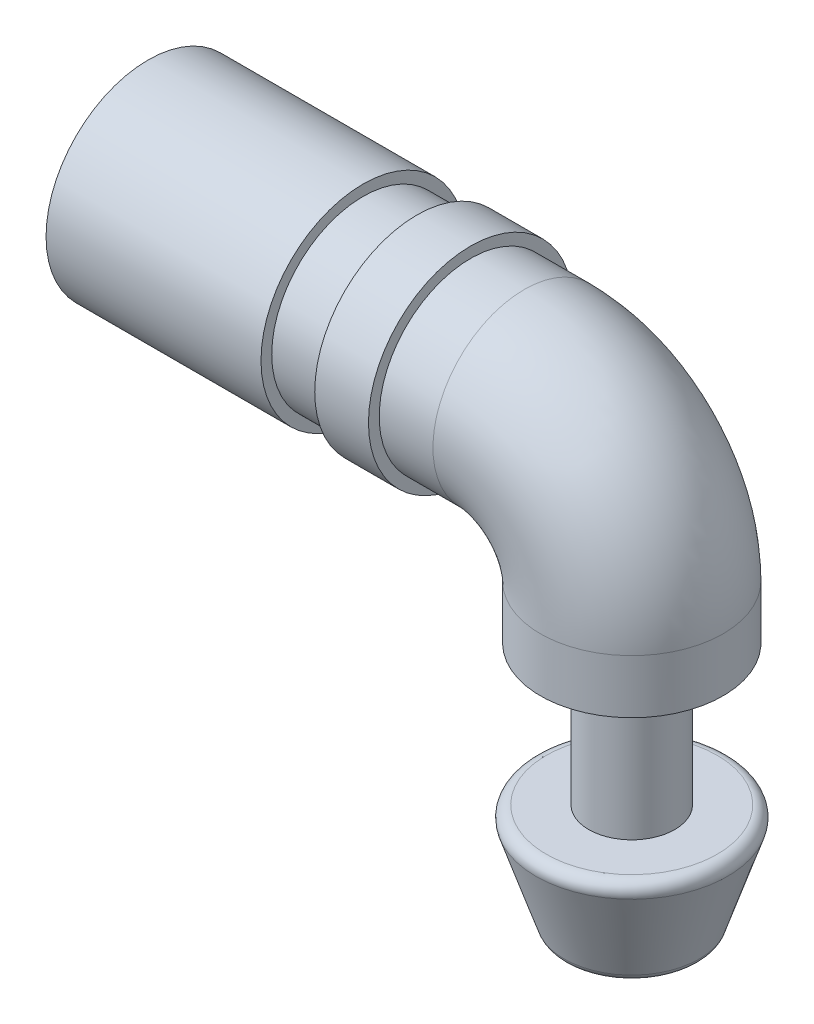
ISO-10303-21;
HEADER;
FILE_DESCRIPTION(('STEP AP214'),'2;1');
FILE_NAME('part.step','',(''),(''),'','','');
FILE_SCHEMA(('AUTOMOTIVE_DESIGN { 1 0 10303 214 1 1 1 1 }'));
ENDSEC;
DATA;
#1=APPLICATION_CONTEXT('core data for automotive mechanical design processes');
#2=APPLICATION_PROTOCOL_DEFINITION('international standard','automotive_design',2000,#1);
#3=PRODUCT_CONTEXT('',#1,'mechanical');
#4=PRODUCT('Part','Part','',(#3));
#5=PRODUCT_RELATED_PRODUCT_CATEGORY('part','',(#4));
#6=PRODUCT_DEFINITION_FORMATION('','',#4);
#7=PRODUCT_DEFINITION_CONTEXT('part definition',#1,'design');
#8=PRODUCT_DEFINITION('design','',#6,#7);
#9=PRODUCT_DEFINITION_SHAPE('','',#8);
#10=(LENGTH_UNIT() NAMED_UNIT(*) SI_UNIT(.MILLI.,.METRE.));
#11=(NAMED_UNIT(*) PLANE_ANGLE_UNIT() SI_UNIT($,.RADIAN.));
#12=(NAMED_UNIT(*) SI_UNIT($,.STERADIAN.) SOLID_ANGLE_UNIT());
#13=UNCERTAINTY_MEASURE_WITH_UNIT(LENGTH_MEASURE(1.E-05),#10,'distance_accuracy_value','');
#14=(GEOMETRIC_REPRESENTATION_CONTEXT(3) GLOBAL_UNCERTAINTY_ASSIGNED_CONTEXT((#13)) GLOBAL_UNIT_ASSIGNED_CONTEXT((#10,
#11,#12)) REPRESENTATION_CONTEXT('',''));
#15=CARTESIAN_POINT('',(0.,0.,0.));
#16=DIRECTION('',(0.,0.,1.));
#17=DIRECTION('',(1.,0.,0.));
#18=AXIS2_PLACEMENT_3D('',#15,#16,#17);
#19=CARTESIAN_POINT('',(0.,0.,0.));
#20=DIRECTION('',(1.,0.,0.));
#21=DIRECTION('',(0.,0.,-1.));
#22=AXIS2_PLACEMENT_3D('',#19,#20,#21);
#23=PLANE('',#22);
#24=CARTESIAN_POINT('',(0.,0.,0.));
#25=DIRECTION('',(-1.,0.,0.));
#26=DIRECTION('',(0.,0.,1.));
#27=AXIS2_PLACEMENT_3D('',#24,#25,#26);
#28=CIRCLE('',#27,9.5);
#29=CARTESIAN_POINT('',(0.,0.,9.5));
#30=VERTEX_POINT('',#29);
#31=EDGE_CURVE('E69',#30,#30,#28,.T.);
#32=ORIENTED_EDGE('',*,*,#31,.T.);
#33=EDGE_LOOP('',(#32));
#34=FACE_BOUND('',#33,.T.);
#35=ADVANCED_FACE('F33',(#34),#23,.F.);
#36=CARTESIAN_POINT('',(0.,0.,0.));
#37=DIRECTION('',(-1.,0.,0.));
#38=DIRECTION('',(0.,0.,1.));
#39=AXIS2_PLACEMENT_3D('',#36,#37,#38);
#40=CYLINDRICAL_SURFACE('',#39,9.5);
#41=ORIENTED_EDGE('',*,*,#31,.F.);
#42=EDGE_LOOP('',(#41));
#43=FACE_BOUND('',#42,.T.);
#44=CARTESIAN_POINT('',(20.,0.,0.));
#45=DIRECTION('',(-1.,0.,0.));
#46=DIRECTION('',(0.,0.,1.));
#47=AXIS2_PLACEMENT_3D('',#44,#45,#46);
#48=CIRCLE('',#47,9.5);
#49=CARTESIAN_POINT('',(20.,0.,9.5));
#50=VERTEX_POINT('',#49);
#51=EDGE_CURVE('E66',#50,#50,#48,.T.);
#52=ORIENTED_EDGE('',*,*,#51,.T.);
#53=EDGE_LOOP('',(#52));
#54=FACE_BOUND('',#53,.T.);
#55=ADVANCED_FACE('F144',(#43,#54),#40,.T.);
#56=CARTESIAN_POINT('',(20.,9.5,0.));
#57=DIRECTION('',(-1.,0.,0.));
#58=DIRECTION('',(0.,0.,1.));
#59=AXIS2_PLACEMENT_3D('',#56,#57,#58);
#60=PLANE('',#59);
#61=ORIENTED_EDGE('',*,*,#51,.F.);
#62=EDGE_LOOP('',(#61));
#63=FACE_BOUND('',#62,.T.);
#64=CARTESIAN_POINT('',(20.,0.,0.));
#65=DIRECTION('',(-1.,0.,0.));
#66=DIRECTION('',(0.,0.,1.));
#67=AXIS2_PLACEMENT_3D('',#64,#65,#66);
#68=CIRCLE('',#67,8.5);
#69=CARTESIAN_POINT('',(20.,0.,8.5));
#70=VERTEX_POINT('',#69);
#71=EDGE_CURVE('E63',#70,#70,#68,.T.);
#72=ORIENTED_EDGE('',*,*,#71,.T.);
#73=EDGE_LOOP('',(#72));
#74=FACE_BOUND('',#73,.T.);
#75=ADVANCED_FACE('F150',(#63,#74),#60,.F.);
#76=CARTESIAN_POINT('',(0.,0.,0.));
#77=DIRECTION('',(-1.,0.,0.));
#78=DIRECTION('',(0.,0.,1.));
#79=AXIS2_PLACEMENT_3D('',#76,#77,#78);
#80=CYLINDRICAL_SURFACE('',#79,8.5);
#81=ORIENTED_EDGE('',*,*,#71,.F.);
#82=EDGE_LOOP('',(#81));
#83=FACE_BOUND('',#82,.T.);
#84=CARTESIAN_POINT('',(25.,0.,0.));
#85=DIRECTION('',(-1.,0.,0.));
#86=DIRECTION('',(0.,0.,1.));
#87=AXIS2_PLACEMENT_3D('',#84,#85,#86);
#88=CIRCLE('',#87,8.5);
#89=CARTESIAN_POINT('',(25.,0.,8.5));
#90=VERTEX_POINT('',#89);
#91=EDGE_CURVE('E60',#90,#90,#88,.T.);
#92=ORIENTED_EDGE('',*,*,#91,.T.);
#93=EDGE_LOOP('',(#92));
#94=FACE_BOUND('',#93,.T.);
#95=ADVANCED_FACE('F139',(#83,#94),#80,.T.);
#96=CARTESIAN_POINT('',(25.,8.5,0.));
#97=DIRECTION('',(1.,0.,0.));
#98=DIRECTION('',(0.,0.,-1.));
#99=AXIS2_PLACEMENT_3D('',#96,#97,#98);
#100=PLANE('',#99);
#101=ORIENTED_EDGE('',*,*,#91,.F.);
#102=EDGE_LOOP('',(#101));
#103=FACE_BOUND('',#102,.T.);
#104=CARTESIAN_POINT('',(25.,0.,0.));
#105=DIRECTION('',(-1.,0.,0.));
#106=DIRECTION('',(0.,0.,1.));
#107=AXIS2_PLACEMENT_3D('',#104,#105,#106);
#108=CIRCLE('',#107,9.5);
#109=CARTESIAN_POINT('',(25.,0.,9.5));
#110=VERTEX_POINT('',#109);
#111=EDGE_CURVE('E51',#110,#110,#108,.T.);
#112=ORIENTED_EDGE('',*,*,#111,.T.);
#113=EDGE_LOOP('',(#112));
#114=FACE_BOUND('',#113,.T.);
#115=ADVANCED_FACE('F133',(#103,#114),#100,.F.);
#116=CARTESIAN_POINT('',(0.,0.,0.));
#117=DIRECTION('',(-1.,0.,0.));
#118=DIRECTION('',(0.,0.,1.));
#119=AXIS2_PLACEMENT_3D('',#116,#117,#118);
#120=CYLINDRICAL_SURFACE('',#119,9.5);
#121=ORIENTED_EDGE('',*,*,#111,.F.);
#122=EDGE_LOOP('',(#121));
#123=FACE_BOUND('',#122,.T.);
#124=CARTESIAN_POINT('',(30.,0.,0.));
#125=DIRECTION('',(-1.,0.,0.));
#126=DIRECTION('',(0.,0.,1.));
#127=AXIS2_PLACEMENT_3D('',#124,#125,#126);
#128=CIRCLE('',#127,9.5);
#129=CARTESIAN_POINT('',(30.,0.,9.5));
#130=VERTEX_POINT('',#129);
#131=EDGE_CURVE('E47',#130,#130,#128,.T.);
#132=ORIENTED_EDGE('',*,*,#131,.T.);
#133=EDGE_LOOP('',(#132));
#134=FACE_BOUND('',#133,.T.);
#135=ADVANCED_FACE('F127',(#123,#134),#120,.T.);
#136=CARTESIAN_POINT('',(30.,9.5,0.));
#137=DIRECTION('',(-1.,0.,0.));
#138=DIRECTION('',(0.,0.,1.));
#139=AXIS2_PLACEMENT_3D('',#136,#137,#138);
#140=PLANE('',#139);
#141=CARTESIAN_POINT('',(30.,0.,0.));
#142=DIRECTION('',(1.,0.,0.));
#143=DIRECTION('',(0.,0.,-1.));
#144=AXIS2_PLACEMENT_3D('',#141,#142,#143);
#145=CIRCLE('',#144,8.5);
#146=CARTESIAN_POINT('',(30.,0.,-8.5));
#147=VERTEX_POINT('',#146);
#148=EDGE_CURVE('E72',#147,#147,#145,.T.);
#149=ORIENTED_EDGE('',*,*,#148,.F.);
#150=EDGE_LOOP('',(#149));
#151=FACE_BOUND('',#150,.T.);
#152=ORIENTED_EDGE('',*,*,#131,.F.);
#153=EDGE_LOOP('',(#152));
#154=FACE_BOUND('',#153,.T.);
#155=ADVANCED_FACE('F124',(#151,#154),#140,.F.);
#156=CARTESIAN_POINT('',(45.,-15.0029464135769,0.));
#157=DIRECTION('',(0.,-1.,0.));
#158=DIRECTION('',(0.,0.,-1.));
#159=AXIS2_PLACEMENT_3D('',#156,#157,#158);
#160=PLANE('',#159);
#161=CARTESIAN_POINT('',(45.,-15.0029464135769,0.));
#162=DIRECTION('',(0.,1.,0.));
#163=DIRECTION('',(0.,0.,1.));
#164=AXIS2_PLACEMENT_3D('',#161,#162,#163);
#165=CIRCLE('',#164,4.);
#166=CARTESIAN_POINT('',(45.,-15.0029464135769,4.));
#167=VERTEX_POINT('',#166);
#168=EDGE_CURVE('E107',#167,#167,#165,.T.);
#169=ORIENTED_EDGE('',*,*,#168,.T.);
#170=EDGE_LOOP('',(#169));
#171=FACE_BOUND('',#170,.T.);
#172=CARTESIAN_POINT('',(45.,-15.0029464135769,0.));
#173=DIRECTION('',(0.,-1.,0.));
#174=DIRECTION('',(0.,0.,-1.));
#175=AXIS2_PLACEMENT_3D('',#172,#173,#174);
#176=CIRCLE('',#175,8.5);
#177=CARTESIAN_POINT('',(45.,-15.0029464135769,-8.5));
#178=VERTEX_POINT('',#177);
#179=EDGE_CURVE('E44',#178,#178,#176,.T.);
#180=ORIENTED_EDGE('',*,*,#179,.T.);
#181=EDGE_LOOP('',(#180));
#182=FACE_BOUND('',#181,.T.);
#183=ADVANCED_FACE('F45',(#171,#182),#160,.T.);
#184=CARTESIAN_POINT('',(30.,0.,0.));
#185=DIRECTION('',(1.,0.,0.));
#186=DIRECTION('',(0.,0.,-1.));
#187=AXIS2_PLACEMENT_3D('',#184,#185,#186);
#188=CYLINDRICAL_SURFACE('',#187,8.5);
#189=CARTESIAN_POINT('',(34.9999999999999,0.,0.));
#190=DIRECTION('',(1.,0.,0.));
#191=DIRECTION('',(0.,0.,-1.));
#192=AXIS2_PLACEMENT_3D('',#189,#190,#191);
#193=CIRCLE('',#192,8.5);
#194=CARTESIAN_POINT('',(34.9999999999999,8.49999999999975,0.));
#195=VERTEX_POINT('',#194);
#196=EDGE_CURVE('E54',#195,#195,#193,.T.);
#197=ORIENTED_EDGE('',*,*,#196,.F.);
#198=EDGE_LOOP('',(#197));
#199=FACE_BOUND('',#198,.T.);
#200=ORIENTED_EDGE('',*,*,#148,.T.);
#201=EDGE_LOOP('',(#200));
#202=FACE_BOUND('',#201,.T.);
#203=ADVANCED_FACE('F118',(#199,#202),#188,.T.);
#204=CARTESIAN_POINT('',(35.,-10.,0.));
#205=DIRECTION('',(0.,0.,-1.));
#206=DIRECTION('',(-1.,0.,0.));
#207=AXIS2_PLACEMENT_3D('',#204,#205,#206);
#208=TOROIDAL_SURFACE('',#207,9.99999999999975,8.5);
#209=CARTESIAN_POINT('',(45.,-10.,0.));
#210=DIRECTION('',(0.,-1.,0.));
#211=DIRECTION('',(0.,0.,-1.));
#212=AXIS2_PLACEMENT_3D('',#209,#210,#211);
#213=CIRCLE('',#212,8.5);
#214=CARTESIAN_POINT('',(53.4999999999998,-10.,0.));
#215=VERTEX_POINT('',#214);
#216=EDGE_CURVE('E48',#215,#215,#213,.T.);
#217=CARTESIAN_POINT('',(35.,-10.,0.));
#218=DIRECTION('',(0.,0.,-1.));
#219=DIRECTION('',(-1.,0.,0.));
#220=AXIS2_PLACEMENT_3D('',#217,#218,#219);
#221=CIRCLE('',#220,18.4999999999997);
#222=EDGE_CURVE('',#195,#215,#221,.T.);
#223=ORIENTED_EDGE('',*,*,#196,.T.);
#224=ORIENTED_EDGE('',*,*,#216,.F.);
#225=ORIENTED_EDGE('',*,*,#222,.T.);
#226=ORIENTED_EDGE('',*,*,#222,.F.);
#227=EDGE_LOOP('',(#223,#225,#224,#226));
#228=FACE_BOUND('',#227,.T.);
#229=ADVANCED_FACE('F116',(#228),#208,.T.);
#230=CARTESIAN_POINT('',(45.,-10.0000000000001,0.));
#231=DIRECTION('',(0.,-1.,0.));
#232=DIRECTION('',(0.,0.,-1.));
#233=AXIS2_PLACEMENT_3D('',#230,#231,#232);
#234=CYLINDRICAL_SURFACE('',#233,8.5);
#235=ORIENTED_EDGE('',*,*,#179,.F.);
#236=EDGE_LOOP('',(#235));
#237=FACE_BOUND('',#236,.T.);
#238=ORIENTED_EDGE('',*,*,#216,.T.);
#239=EDGE_LOOP('',(#238));
#240=FACE_BOUND('',#239,.T.);
#241=ADVANCED_FACE('F129',(#237,#240),#234,.T.);
#242=CARTESIAN_POINT('',(45.,-15.0029464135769,0.));
#243=DIRECTION('',(0.,1.,0.));
#244=DIRECTION('',(0.,0.,1.));
#245=AXIS2_PLACEMENT_3D('',#242,#243,#244);
#246=CYLINDRICAL_SURFACE('',#245,4.);
#247=ORIENTED_EDGE('',*,*,#168,.F.);
#248=EDGE_LOOP('',(#247));
#249=FACE_BOUND('',#248,.T.);
#250=CARTESIAN_POINT('',(45.,-28.0270848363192,0.));
#251=DIRECTION('',(0.,1.,0.));
#252=DIRECTION('',(0.,0.,1.));
#253=AXIS2_PLACEMENT_3D('',#250,#251,#252);
#254=CIRCLE('',#253,4.);
#255=CARTESIAN_POINT('',(45.,-28.0270848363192,4.));
#256=VERTEX_POINT('',#255);
#257=EDGE_CURVE('E105',#256,#256,#254,.T.);
#258=ORIENTED_EDGE('',*,*,#257,.T.);
#259=EDGE_LOOP('',(#258));
#260=FACE_BOUND('',#259,.T.);
#261=ADVANCED_FACE('F101',(#249,#260),#246,.T.);
#262=CARTESIAN_POINT('',(49.,-28.0270848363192,0.));
#263=DIRECTION('',(0.,-1.,0.));
#264=DIRECTION('',(0.,0.,-1.));
#265=AXIS2_PLACEMENT_3D('',#262,#263,#264);
#266=PLANE('',#265);
#267=CARTESIAN_POINT('',(45.,-28.0270848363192,0.));
#268=DIRECTION('',(0.,-1.,0.));
#269=DIRECTION('',(0.,0.,-1.));
#270=AXIS2_PLACEMENT_3D('',#267,#268,#269);
#271=CIRCLE('',#270,7.96493653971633);
#272=CARTESIAN_POINT('',(45.,-28.0270848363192,-7.96493653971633));
#273=VERTEX_POINT('',#272);
#274=EDGE_CURVE('E11',#273,#273,#271,.F.);
#275=ORIENTED_EDGE('',*,*,#274,.T.);
#276=EDGE_LOOP('',(#275));
#277=FACE_BOUND('',#276,.T.);
#278=ORIENTED_EDGE('',*,*,#257,.F.);
#279=EDGE_LOOP('',(#278));
#280=FACE_BOUND('',#279,.T.);
#281=ADVANCED_FACE('F91',(#277,#280),#266,.F.);
#282=CARTESIAN_POINT('',(45.,-38.0029464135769,0.));
#283=DIRECTION('',(0.,1.,0.));
#284=DIRECTION('',(0.,0.,1.));
#285=AXIS2_PLACEMENT_3D('',#282,#283,#284);
#286=CONICAL_SURFACE('',#285,6.04795720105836,0.319578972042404);
#287=CARTESIAN_POINT('',(45.,-37.3171132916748,0.));
#288=DIRECTION('',(0.,-1.,0.));
#289=DIRECTION('',(0.,0.,-1.));
#290=AXIS2_PLACEMENT_3D('',#287,#288,#289);
#291=CIRCLE('',#290,6.27491461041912);
#292=CARTESIAN_POINT('',(45.,-37.3171132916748,-6.27491461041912));
#293=VERTEX_POINT('',#292);
#294=EDGE_CURVE('E76',#293,#293,#291,.F.);
#295=ORIENTED_EDGE('',*,*,#294,.T.);
#296=EDGE_LOOP('',(#295));
#297=FACE_BOUND('',#296,.T.);
#298=CARTESIAN_POINT('',(45.,-29.341251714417,0.));
#299=DIRECTION('',(0.,-1.,0.));
#300=DIRECTION('',(0.,0.,-1.));
#301=AXIS2_PLACEMENT_3D('',#298,#299,#300);
#302=CIRCLE('',#301,8.91430431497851);
#303=CARTESIAN_POINT('',(45.,-29.341251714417,-8.91430431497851));
#304=VERTEX_POINT('',#303);
#305=EDGE_CURVE('E73',#304,#304,#302,.T.);
#306=ORIENTED_EDGE('',*,*,#305,.T.);
#307=EDGE_LOOP('',(#306));
#308=FACE_BOUND('',#307,.T.);
#309=ADVANCED_FACE('F88',(#297,#308),#286,.T.);
#310=CARTESIAN_POINT('',(51.0479572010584,-38.0029464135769,0.));
#311=DIRECTION('',(0.,1.,0.));
#312=DIRECTION('',(0.,0.,1.));
#313=AXIS2_PLACEMENT_3D('',#310,#311,#312);
#314=PLANE('',#313);
#315=CARTESIAN_POINT('',(45.,-38.0029464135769,0.));
#316=DIRECTION('',(0.,1.,0.));
#317=DIRECTION('',(0.,0.,1.));
#318=AXIS2_PLACEMENT_3D('',#315,#316,#317);
#319=CIRCLE('',#318,5.32554683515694);
#320=CARTESIAN_POINT('',(45.,-38.0029464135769,5.32554683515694));
#321=VERTEX_POINT('',#320);
#322=EDGE_CURVE('E40',#321,#321,#319,.F.);
#323=ORIENTED_EDGE('',*,*,#322,.T.);
#324=EDGE_LOOP('',(#323));
#325=FACE_BOUND('',#324,.T.);
#326=ADVANCED_FACE('F81',(#325),#314,.F.);
#327=CARTESIAN_POINT('',(45.,-37.0029464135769,0.));
#328=DIRECTION('',(0.,1.,0.));
#329=DIRECTION('',(0.,0.,1.));
#330=AXIS2_PLACEMENT_3D('',#327,#328,#329);
#331=TOROIDAL_SURFACE('',#330,5.32554683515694,1.);
#332=ORIENTED_EDGE('',*,*,#322,.F.);
#333=EDGE_LOOP('',(#332));
#334=FACE_BOUND('',#333,.T.);
#335=ORIENTED_EDGE('',*,*,#294,.F.);
#336=EDGE_LOOP('',(#335));
#337=FACE_BOUND('',#336,.T.);
#338=ADVANCED_FACE('F83',(#334,#337),#331,.T.);
#339=CARTESIAN_POINT('',(45.,-29.0270848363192,0.));
#340=DIRECTION('',(0.,-1.,0.));
#341=DIRECTION('',(0.,0.,-1.));
#342=AXIS2_PLACEMENT_3D('',#339,#340,#341);
#343=TOROIDAL_SURFACE('',#342,7.96493653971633,1.);
#344=ORIENTED_EDGE('',*,*,#305,.F.);
#345=EDGE_LOOP('',(#344));
#346=FACE_BOUND('',#345,.T.);
#347=ORIENTED_EDGE('',*,*,#274,.F.);
#348=EDGE_LOOP('',(#347));
#349=FACE_BOUND('',#348,.T.);
#350=ADVANCED_FACE('F35',(#346,#349),#343,.T.);
#351=CLOSED_SHELL('',(#35,#55,#75,#95,#115,#135,#155,#183,#203,#229,#241,#261,#281,#309,#326,
#338,#350));
#352=MANIFOLD_SOLID_BREP('B2',#351);
#353=ADVANCED_BREP_SHAPE_REPRESENTATION('',(#18,#352),#14);
#354=SHAPE_DEFINITION_REPRESENTATION(#9,#353);
ENDSEC;
END-ISO-10303-21;
